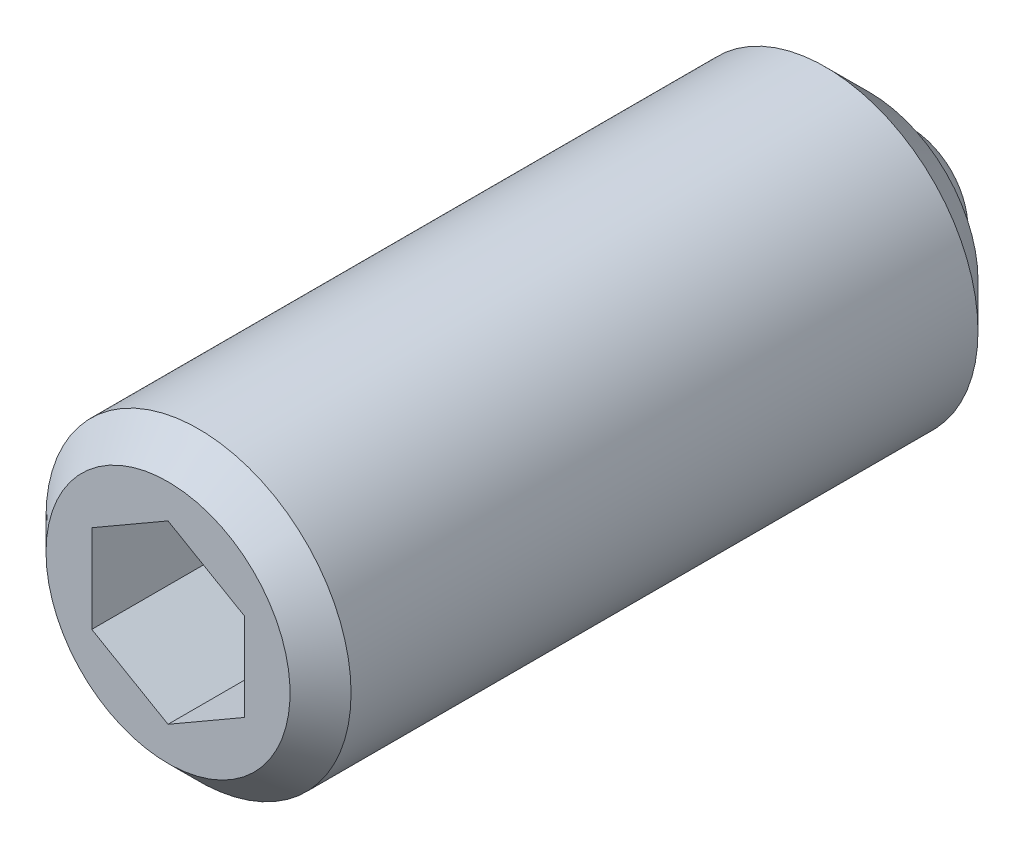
ISO-10303-21;
HEADER;
FILE_DESCRIPTION(('STEP AP214'),'2;1');
FILE_NAME('part.step','',(''),(''),'','','');
FILE_SCHEMA(('AUTOMOTIVE_DESIGN { 1 0 10303 214 1 1 1 1 }'));
ENDSEC;
DATA;
#1=APPLICATION_CONTEXT('core data for automotive mechanical design processes');
#2=APPLICATION_PROTOCOL_DEFINITION('international standard','automotive_design',2000,#1);
#3=PRODUCT_CONTEXT('',#1,'mechanical');
#4=PRODUCT('Part','Part','',(#3));
#5=PRODUCT_RELATED_PRODUCT_CATEGORY('part','',(#4));
#6=PRODUCT_DEFINITION_FORMATION('','',#4);
#7=PRODUCT_DEFINITION_CONTEXT('part definition',#1,'design');
#8=PRODUCT_DEFINITION('design','',#6,#7);
#9=PRODUCT_DEFINITION_SHAPE('','',#8);
#10=(LENGTH_UNIT() NAMED_UNIT(*) SI_UNIT(.MILLI.,.METRE.));
#11=(NAMED_UNIT(*) PLANE_ANGLE_UNIT() SI_UNIT($,.RADIAN.));
#12=(NAMED_UNIT(*) SI_UNIT($,.STERADIAN.) SOLID_ANGLE_UNIT());
#13=UNCERTAINTY_MEASURE_WITH_UNIT(LENGTH_MEASURE(1.E-05),#10,'distance_accuracy_value','');
#14=(GEOMETRIC_REPRESENTATION_CONTEXT(3) GLOBAL_UNCERTAINTY_ASSIGNED_CONTEXT((#13)) GLOBAL_UNIT_ASSIGNED_CONTEXT((#10,
#11,#12)) REPRESENTATION_CONTEXT('',''));
#15=CARTESIAN_POINT('',(0.,0.,0.));
#16=DIRECTION('',(0.,0.,1.));
#17=DIRECTION('',(1.,0.,0.));
#18=AXIS2_PLACEMENT_3D('',#15,#16,#17);
#19=CARTESIAN_POINT('',(1.3070170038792,4.84455592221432,24.9999999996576));
#20=DIRECTION('',(-2.62001455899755E-10,0.,-1.));
#21=DIRECTION('',(0.500000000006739,-0.866025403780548,-1.31012271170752E-10));
#22=AXIS2_PLACEMENT_3D('',#19,#20,#21);
#23=PLANE('',#22);
#24=CARTESIAN_POINT('',(6.55003639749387E-09,-3.33224032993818E-13,25.));
#25=DIRECTION('',(-2.62001455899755E-10,0.,-1.));
#26=DIRECTION('',(-1.,0.,2.62001455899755E-10));
#27=AXIS2_PLACEMENT_3D('',#24,#25,#26);
#28=CIRCLE('',#27,4.);
#29=CARTESIAN_POINT('',(-3.99999999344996,-3.33224032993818E-13,25.000000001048));
#30=VERTEX_POINT('',#29);
#31=EDGE_CURVE('E23',#30,#30,#28,.F.);
#32=ORIENTED_EDGE('',*,*,#31,.T.);
#33=EDGE_LOOP('',(#32));
#34=FACE_BOUND('',#33,.T.);
#35=DIRECTION('',(0.,1.,0.));
#36=VECTOR('',#35,1.);
#37=CARTESIAN_POINT('',(-2.50000001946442,-1.44337568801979,25.000000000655));
#38=LINE('',#37,#36);
#39=CARTESIAN_POINT('',(-2.50000001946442,1.44337565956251,25.000000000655));
#40=VERTEX_POINT('',#39);
#41=CARTESIAN_POINT('',(-2.50000001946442,-1.44337568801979,25.000000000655));
#42=VERTEX_POINT('',#41);
#43=EDGE_CURVE('E31',#40,#42,#38,.F.);
#44=ORIENTED_EDGE('',*,*,#43,.F.);
#45=DIRECTION('',(-0.866025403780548,-0.500000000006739,2.26893252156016E-10));
#46=VECTOR('',#45,1.);
#47=CARTESIAN_POINT('',(-1.25000002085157,2.16506349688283,25.0000000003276));
#48=LINE('',#47,#46);
#49=CARTESIAN_POINT('',(-2.08347295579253E-08,2.88675133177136,25.));
#50=VERTEX_POINT('',#49);
#51=EDGE_CURVE('E103',#50,#40,#48,.T.);
#52=ORIENTED_EDGE('',*,*,#51,.F.);
#53=DIRECTION('',(0.86602540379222,-0.499999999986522,-2.26906581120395E-10));
#54=VECTOR('',#53,1.);
#55=CARTESIAN_POINT('',(-1.94307291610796E-08,2.88675133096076,25.));
#56=LINE('',#55,#54);
#57=CARTESIAN_POINT('',(2.49999998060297,1.44337565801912,24.999999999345));
#58=VERTEX_POINT('',#57);
#59=EDGE_CURVE('E105',#58,#50,#56,.F.);
#60=ORIENTED_EDGE('',*,*,#59,.F.);
#61=DIRECTION('',(0.,-1.,0.));
#62=VECTOR('',#61,1.);
#63=CARTESIAN_POINT('',(2.49999998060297,1.44337565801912,24.999999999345));
#64=LINE('',#63,#62);
#65=CARTESIAN_POINT('',(2.49999998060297,-1.44337568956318,24.999999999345));
#66=VERTEX_POINT('',#65);
#67=EDGE_CURVE('E111',#66,#58,#64,.F.);
#68=ORIENTED_EDGE('',*,*,#67,.F.);
#69=DIRECTION('',(0.866025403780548,0.500000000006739,-2.26893252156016E-10));
#70=VECTOR('',#69,1.);
#71=CARTESIAN_POINT('',(1.24999998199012,-2.1650635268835,24.9999999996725));
#72=LINE('',#71,#70);
#73=CARTESIAN_POINT('',(-1.80267218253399E-08,-2.88675136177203,25.));
#74=VERTEX_POINT('',#73);
#75=EDGE_CURVE('E46',#74,#66,#72,.T.);
#76=ORIENTED_EDGE('',*,*,#75,.F.);
#77=DIRECTION('',(-0.86602540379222,0.499999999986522,2.26906581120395E-10));
#78=VECTOR('',#77,1.);
#79=CARTESIAN_POINT('',(-1.94307239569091E-08,-2.88675136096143,25.));
#80=LINE('',#79,#78);
#81=EDGE_CURVE('E114',#42,#74,#80,.F.);
#82=ORIENTED_EDGE('',*,*,#81,.F.);
#83=EDGE_LOOP('',(#44,#52,#60,#68,#76,#82));
#84=FACE_BOUND('',#83,.T.);
#85=ADVANCED_FACE('F14',(#34,#84),#23,.F.);
#86=CARTESIAN_POINT('',(1.27999997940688,3.62575967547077,20.9999999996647));
#87=DIRECTION('',(-2.62001455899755E-10,0.,-1.));
#88=DIRECTION('',(0.500000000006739,-0.866025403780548,-1.31012271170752E-10));
#89=AXIS2_PLACEMENT_3D('',#86,#87,#88);
#90=PLANE('',#89);
#91=DIRECTION('',(0.86602540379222,-0.499999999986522,-2.26906581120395E-10));
#92=VECTOR('',#91,1.);
#93=CARTESIAN_POINT('',(-1.25000002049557,-2.16506352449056,21.0000000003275));
#94=LINE('',#93,#92);
#95=CARTESIAN_POINT('',(-2.50000001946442,-1.4433756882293,21.000000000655));
#96=VERTEX_POINT('',#95);
#97=CARTESIAN_POINT('',(-2.0136209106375E-08,-2.88675136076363,21.));
#98=VERTEX_POINT('',#97);
#99=EDGE_CURVE('E78',#96,#98,#94,.T.);
#100=ORIENTED_EDGE('',*,*,#99,.T.);
#101=DIRECTION('',(0.866025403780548,0.500000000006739,-2.26893252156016E-10));
#102=VECTOR('',#101,1.);
#103=CARTESIAN_POINT('',(1.24999997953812,-2.16506352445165,20.9999999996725));
#104=LINE('',#103,#102);
#105=CARTESIAN_POINT('',(2.49999997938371,-1.4433756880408,20.999999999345));
#106=VERTEX_POINT('',#105);
#107=EDGE_CURVE('E72',#98,#106,#104,.T.);
#108=ORIENTED_EDGE('',*,*,#107,.T.);
#109=DIRECTION('',(0.,1.,0.));
#110=VECTOR('',#109,1.);
#111=CARTESIAN_POINT('',(2.49999997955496,-1.49613732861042E-08,20.999999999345));
#112=LINE('',#111,#110);
#113=CARTESIAN_POINT('',(2.49999997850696,1.44337565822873,20.999999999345));
#114=VERTEX_POINT('',#113);
#115=EDGE_CURVE('E75',#106,#114,#112,.T.);
#116=ORIENTED_EDGE('',*,*,#115,.T.);
#117=DIRECTION('',(-0.86602540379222,0.499999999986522,2.26906581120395E-10));
#118=VECTOR('',#117,1.);
#119=CARTESIAN_POINT('',(1.24999997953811,2.16506349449,20.9999999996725));
#120=LINE('',#119,#118);
#121=CARTESIAN_POINT('',(-2.0649992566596E-08,2.88675133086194,21.));
#122=VERTEX_POINT('',#121);
#123=EDGE_CURVE('E91',#114,#122,#120,.T.);
#124=ORIENTED_EDGE('',*,*,#123,.T.);
#125=DIRECTION('',(-0.866025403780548,-0.500000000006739,2.26893252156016E-10));
#126=VECTOR('',#125,1.);
#127=CARTESIAN_POINT('',(-1.25000002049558,2.16506349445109,21.0000000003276));
#128=LINE('',#127,#126);
#129=CARTESIAN_POINT('',(-2.50000002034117,1.44337565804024,21.000000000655));
#130=VERTEX_POINT('',#129);
#131=EDGE_CURVE('E96',#122,#130,#128,.T.);
#132=ORIENTED_EDGE('',*,*,#131,.T.);
#133=DIRECTION('',(0.,-1.,0.));
#134=VECTOR('',#133,1.);
#135=CARTESIAN_POINT('',(-2.50000002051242,-1.50391845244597E-08,21.000000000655));
#136=LINE('',#135,#134);
#137=EDGE_CURVE('E99',#130,#96,#136,.T.);
#138=ORIENTED_EDGE('',*,*,#137,.T.);
#139=EDGE_LOOP('',(#100,#108,#116,#124,#132,#138));
#140=FACE_BOUND('',#139,.T.);
#141=ADVANCED_FACE('F73',(#140),#90,.F.);
#142=CARTESIAN_POINT('',(2.49999998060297,-1.44337568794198,24.999999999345));
#143=DIRECTION('',(0.500000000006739,-0.866025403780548,-1.31012271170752E-10));
#144=DIRECTION('',(-0.866025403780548,-0.500000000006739,2.26893252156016E-10));
#145=AXIS2_PLACEMENT_3D('',#142,#143,#144);
#146=PLANE('',#145);
#147=DIRECTION('',(-2.62001455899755E-10,0.,-1.));
#148=VECTOR('',#147,1.);
#149=CARTESIAN_POINT('',(2.49999998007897,-1.44337568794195,22.999999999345));
#150=LINE('',#149,#148);
#151=EDGE_CURVE('E79',#66,#106,#150,.T.);
#152=ORIENTED_EDGE('',*,*,#151,.T.);
#153=ORIENTED_EDGE('',*,*,#107,.F.);
#154=DIRECTION('',(2.62001455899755E-10,0.,1.));
#155=VECTOR('',#154,1.);
#156=CARTESIAN_POINT('',(-1.99547260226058E-08,-2.8867513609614,23.));
#157=LINE('',#156,#155);
#158=EDGE_CURVE('E52',#98,#74,#157,.T.);
#159=ORIENTED_EDGE('',*,*,#158,.T.);
#160=ORIENTED_EDGE('',*,*,#75,.T.);
#161=EDGE_LOOP('',(#152,#153,#159,#160));
#162=FACE_BOUND('',#161,.T.);
#163=ADVANCED_FACE('F82',(#162),#146,.F.);
#164=CARTESIAN_POINT('',(2.49999998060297,1.44337565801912,24.999999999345));
#165=DIRECTION('',(1.,0.,-2.62001455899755E-10));
#166=DIRECTION('',(0.,-1.,0.));
#167=AXIS2_PLACEMENT_3D('',#164,#165,#166);
#168=PLANE('',#167);
#169=DIRECTION('',(-2.62001455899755E-10,0.,-1.));
#170=VECTOR('',#169,1.);
#171=CARTESIAN_POINT('',(2.49999998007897,1.44337565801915,22.999999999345));
#172=LINE('',#171,#170);
#173=EDGE_CURVE('E88',#58,#114,#172,.T.);
#174=ORIENTED_EDGE('',*,*,#173,.T.);
#175=ORIENTED_EDGE('',*,*,#115,.F.);
#176=ORIENTED_EDGE('',*,*,#151,.F.);
#177=ORIENTED_EDGE('',*,*,#67,.T.);
#178=EDGE_LOOP('',(#174,#175,#176,#177));
#179=FACE_BOUND('',#178,.T.);
#180=ADVANCED_FACE('F86',(#179),#168,.F.);
#181=CARTESIAN_POINT('',(-1.94307291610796E-08,2.88675133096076,25.));
#182=DIRECTION('',(0.499999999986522,0.866025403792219,-1.30989184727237E-10));
#183=DIRECTION('',(0.86602540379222,-0.499999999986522,-2.26906581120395E-10));
#184=AXIS2_PLACEMENT_3D('',#181,#182,#183);
#185=PLANE('',#184);
#186=DIRECTION('',(-2.62001455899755E-10,0.,-1.));
#187=VECTOR('',#186,1.);
#188=CARTESIAN_POINT('',(-1.99547329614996E-08,2.88675133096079,23.));
#189=LINE('',#188,#187);
#190=EDGE_CURVE('E95',#50,#122,#189,.T.);
#191=ORIENTED_EDGE('',*,*,#190,.T.);
#192=ORIENTED_EDGE('',*,*,#123,.F.);
#193=ORIENTED_EDGE('',*,*,#173,.F.);
#194=ORIENTED_EDGE('',*,*,#59,.T.);
#195=EDGE_LOOP('',(#191,#192,#193,#194));
#196=FACE_BOUND('',#195,.T.);
#197=ADVANCED_FACE('F166',(#196),#185,.F.);
#198=CARTESIAN_POINT('',(-2.50000001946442,1.44337565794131,25.000000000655));
#199=DIRECTION('',(-0.500000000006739,0.866025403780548,1.31012271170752E-10));
#200=DIRECTION('',(0.866025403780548,0.500000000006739,-2.26893252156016E-10));
#201=AXIS2_PLACEMENT_3D('',#198,#199,#200);
#202=PLANE('',#201);
#203=DIRECTION('',(-2.62001455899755E-10,0.,-1.));
#204=VECTOR('',#203,1.);
#205=CARTESIAN_POINT('',(-2.50000001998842,1.44337565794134,23.000000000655));
#206=LINE('',#205,#204);
#207=EDGE_CURVE('E98',#40,#130,#206,.T.);
#208=ORIENTED_EDGE('',*,*,#207,.T.);
#209=ORIENTED_EDGE('',*,*,#131,.F.);
#210=ORIENTED_EDGE('',*,*,#190,.F.);
#211=ORIENTED_EDGE('',*,*,#51,.T.);
#212=EDGE_LOOP('',(#208,#209,#210,#211));
#213=FACE_BOUND('',#212,.T.);
#214=ADVANCED_FACE('F161',(#213),#202,.F.);
#215=CARTESIAN_POINT('',(-2.50000001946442,-1.44337568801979,25.000000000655));
#216=DIRECTION('',(-1.,0.,2.62001455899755E-10));
#217=DIRECTION('',(0.,1.,0.));
#218=AXIS2_PLACEMENT_3D('',#215,#216,#217);
#219=PLANE('',#218);
#220=DIRECTION('',(-2.62001455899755E-10,0.,-1.));
#221=VECTOR('',#220,1.);
#222=CARTESIAN_POINT('',(-2.50000001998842,-1.44337568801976,23.000000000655));
#223=LINE('',#222,#221);
#224=EDGE_CURVE('E101',#42,#96,#223,.T.);
#225=ORIENTED_EDGE('',*,*,#224,.T.);
#226=ORIENTED_EDGE('',*,*,#137,.F.);
#227=ORIENTED_EDGE('',*,*,#207,.F.);
#228=ORIENTED_EDGE('',*,*,#43,.T.);
#229=EDGE_LOOP('',(#225,#226,#227,#228));
#230=FACE_BOUND('',#229,.T.);
#231=ADVANCED_FACE('F152',(#230),#219,.F.);
#232=CARTESIAN_POINT('',(-1.94307239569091E-08,-2.88675136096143,25.));
#233=DIRECTION('',(-0.499999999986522,-0.866025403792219,1.30989184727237E-10));
#234=DIRECTION('',(-0.86602540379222,0.499999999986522,2.26906581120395E-10));
#235=AXIS2_PLACEMENT_3D('',#232,#233,#234);
#236=PLANE('',#235);
#237=ORIENTED_EDGE('',*,*,#158,.F.);
#238=ORIENTED_EDGE('',*,*,#99,.F.);
#239=ORIENTED_EDGE('',*,*,#224,.F.);
#240=ORIENTED_EDGE('',*,*,#81,.T.);
#241=EDGE_LOOP('',(#237,#238,#239,#240));
#242=FACE_BOUND('',#241,.T.);
#243=ADVANCED_FACE('F143',(#242),#236,.F.);
#244=CARTESIAN_POINT('',(-3.18125721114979E-09,1.61842056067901E-13,-12.1421356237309));
#245=DIRECTION('',(2.62001455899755E-10,0.,1.));
#246=DIRECTION('',(1.,0.,-2.62001455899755E-10));
#247=AXIS2_PLACEMENT_3D('',#244,#245,#246);
#248=CYLINDRICAL_SURFACE('',#247,5.);
#249=CARTESIAN_POINT('',(6.28803494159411E-09,-3.19895071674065E-13,24.));
#250=DIRECTION('',(-2.62001455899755E-10,0.,-1.));
#251=DIRECTION('',(-1.,0.,2.62001455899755E-10));
#252=AXIS2_PLACEMENT_3D('',#249,#250,#251);
#253=CIRCLE('',#252,5.);
#254=CARTESIAN_POINT('',(-4.99999999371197,-3.19895071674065E-13,24.00000000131));
#255=VERTEX_POINT('',#254);
#256=EDGE_CURVE('E9',#255,#255,#253,.T.);
#257=ORIENTED_EDGE('',*,*,#256,.T.);
#258=EDGE_LOOP('',(#257));
#259=FACE_BOUND('',#258,.T.);
#260=CARTESIAN_POINT('',(9.0390502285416E-10,0.,3.45));
#261=DIRECTION('',(2.62001455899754E-10,0.,1.));
#262=DIRECTION('',(1.,0.,-2.62001455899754E-10));
#263=AXIS2_PLACEMENT_3D('',#260,#261,#262);
#264=CIRCLE('',#263,5.);
#265=CARTESIAN_POINT('',(5.00000000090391,0.,3.44999999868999));
#266=VERTEX_POINT('',#265);
#267=EDGE_CURVE('E124',#266,#266,#264,.T.);
#268=ORIENTED_EDGE('',*,*,#267,.T.);
#269=EDGE_LOOP('',(#268));
#270=FACE_BOUND('',#269,.T.);
#271=ADVANCED_FACE('F148',(#259,#270),#248,.T.);
#272=CARTESIAN_POINT('',(0.,0.,3.));
#273=DIRECTION('',(0.,0.,-1.));
#274=DIRECTION('',(-1.,0.,0.));
#275=AXIS2_PLACEMENT_3D('',#272,#273,#274);
#276=SPHERICAL_SURFACE('',#275,3.);
#277=CARTESIAN_POINT('',(-2.62000670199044E-10,0.,2.));
#278=DIRECTION('',(2.62001455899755E-10,0.,1.));
#279=DIRECTION('',(1.,0.,-2.62001455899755E-10));
#280=AXIS2_PLACEMENT_3D('',#277,#278,#279);
#281=CIRCLE('',#280,2.82842712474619);
#282=CARTESIAN_POINT('',(2.82842712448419,0.,1.99999999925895));
#283=VERTEX_POINT('',#282);
#284=EDGE_CURVE('E80',#283,#283,#281,.T.);
#285=ORIENTED_EDGE('',*,*,#284,.F.);
#286=EDGE_LOOP('',(#285));
#287=FACE_BOUND('',#286,.T.);
#288=ADVANCED_FACE('F158',(#287),#276,.T.);
#289=CARTESIAN_POINT('',(4.91828866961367,-1.30880186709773,1.99999999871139));
#290=DIRECTION('',(2.62001455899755E-10,0.,1.));
#291=DIRECTION('',(-0.500000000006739,0.866025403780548,1.31012271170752E-10));
#292=AXIS2_PLACEMENT_3D('',#289,#290,#291);
#293=PLANE('',#292);
#294=CARTESIAN_POINT('',(5.24002911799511E-10,0.,2.));
#295=DIRECTION('',(2.62001455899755E-10,0.,1.));
#296=DIRECTION('',(1.,0.,-2.62001455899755E-10));
#297=AXIS2_PLACEMENT_3D('',#294,#295,#296);
#298=CIRCLE('',#297,3.55);
#299=CARTESIAN_POINT('',(3.550000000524,0.,1.99999999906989));
#300=VERTEX_POINT('',#299);
#301=EDGE_CURVE('E116',#300,#300,#298,.F.);
#302=ORIENTED_EDGE('',*,*,#301,.T.);
#303=EDGE_LOOP('',(#302));
#304=FACE_BOUND('',#303,.T.);
#305=ORIENTED_EDGE('',*,*,#284,.T.);
#306=EDGE_LOOP('',(#305));
#307=FACE_BOUND('',#306,.T.);
#308=ADVANCED_FACE('F138',(#304,#307),#293,.F.);
#309=CARTESIAN_POINT('',(5.24002911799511E-10,0.,2.));
#310=DIRECTION('',(2.62001455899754E-10,0.,1.));
#311=DIRECTION('',(1.,0.,-2.62001455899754E-10));
#312=AXIS2_PLACEMENT_3D('',#309,#310,#311);
#313=CONICAL_SURFACE('',#312,3.55,0.785398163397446);
#314=ORIENTED_EDGE('',*,*,#267,.F.);
#315=EDGE_LOOP('',(#314));
#316=FACE_BOUND('',#315,.T.);
#317=ORIENTED_EDGE('',*,*,#301,.F.);
#318=EDGE_LOOP('',(#317));
#319=FACE_BOUND('',#318,.T.);
#320=ADVANCED_FACE('F132',(#316,#319),#313,.T.);
#321=CARTESIAN_POINT('',(6.55003639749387E-09,-3.33224032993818E-13,25.));
#322=DIRECTION('',(-2.62001455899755E-10,0.,-1.));
#323=DIRECTION('',(-1.,0.,2.62001455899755E-10));
#324=AXIS2_PLACEMENT_3D('',#321,#322,#323);
#325=CONICAL_SURFACE('',#324,4.,0.785398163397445);
#326=ORIENTED_EDGE('',*,*,#256,.F.);
#327=EDGE_LOOP('',(#326));
#328=FACE_BOUND('',#327,.T.);
#329=ORIENTED_EDGE('',*,*,#31,.F.);
#330=EDGE_LOOP('',(#329));
#331=FACE_BOUND('',#330,.T.);
#332=ADVANCED_FACE('F16',(#328,#331),#325,.T.);
#333=CLOSED_SHELL('',(#85,#141,#163,#180,#197,#214,#231,#243,#271,#288,#308,#320,#332));
#334=MANIFOLD_SOLID_BREP('B1',#333);
#335=ADVANCED_BREP_SHAPE_REPRESENTATION('',(#18,#334),#14);
#336=SHAPE_DEFINITION_REPRESENTATION(#9,#335);
ENDSEC;
END-ISO-10303-21;
